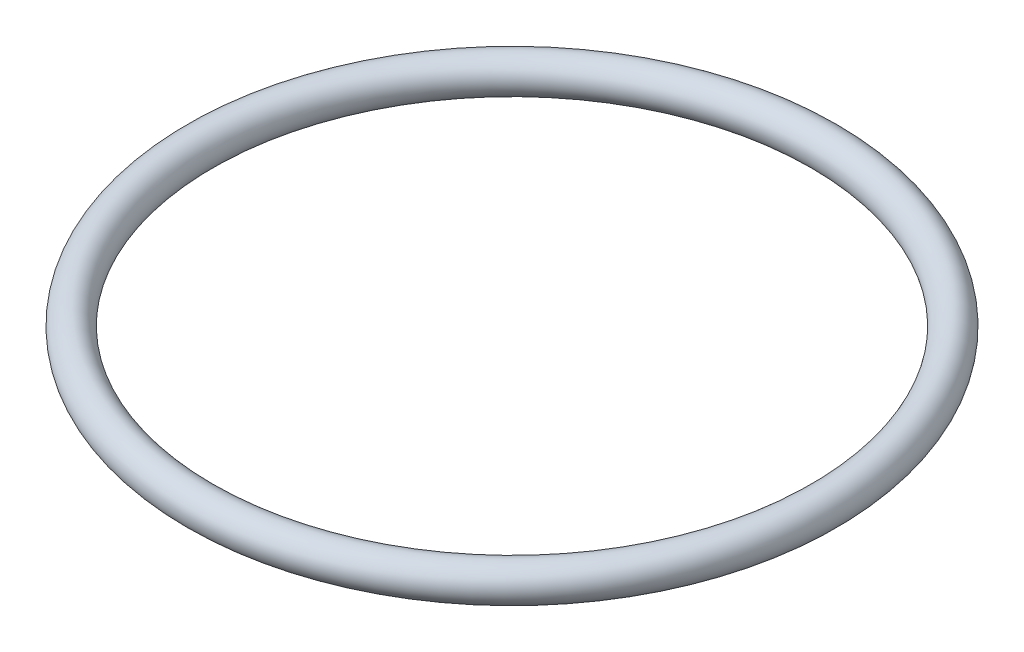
from build123d import *

# Parameters (mm, degrees)
ESQUISSE1_R = 1


with BuildPart() as part:
    # Esquisse1 → Base-R_volution (revolve)
    with BuildSketch(Plane.XY, mode=Mode.PRIVATE) as base_r_volution_sk:
        with Locations((17.5, 0)):
            Circle(ESQUISSE1_R)
    revolve(base_r_volution_sk.sketch.rotate(Axis((0, 11.700761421, 0), (0, -1, 0)), 90), axis=Axis((0, 11.700761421, 0), (0, -1, 0)))


solid = part.part
